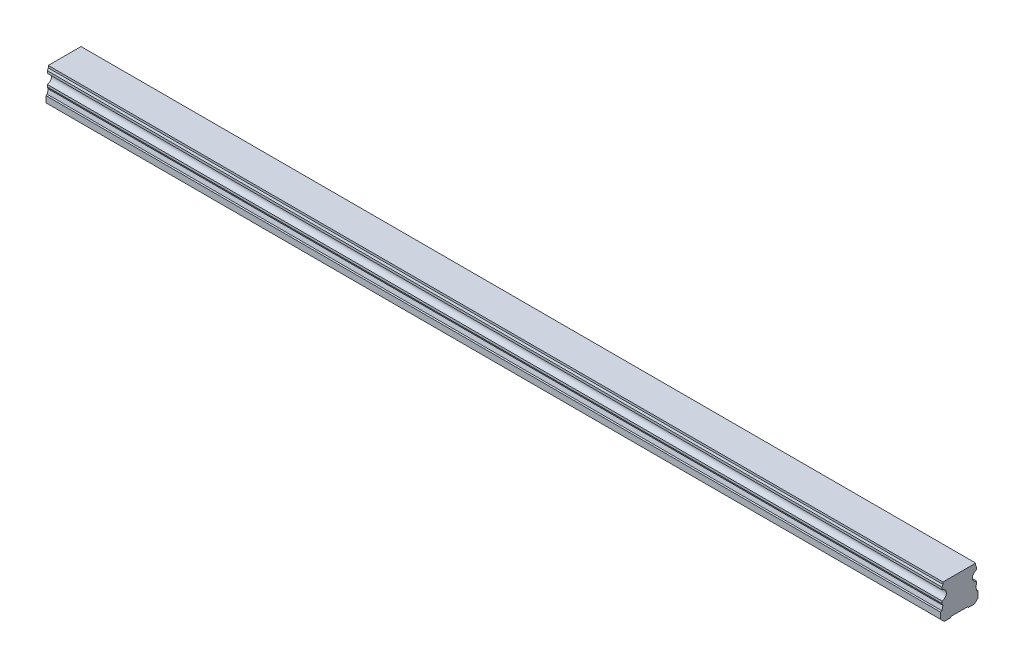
from build123d import *

# Parameters (mm, degrees)
BOSS_EXTRUDE1_DEPTH        = 360
SKETCH3_R                  = 2.5
SKETCH3_R_2                = 2.1
CUT_EXTRUDE3_DEPTH         = 7
SKETCH3_2_R                = 2.1
CUT_EXTRUDE4_DEPTH         = 9.5
CHAMFER1_SIZE              = 0.4
LPATTERN2_COUNT            = 6
LPATTERN2_PITCH            = 60
CHAMFER1_OF_LPATTERN2_SIZE = 0.4


with BuildPart() as part:
    # Sketch1 → Boss-Extrude1 (new body)
    with BuildSketch(Plane(origin=(0, 0, 0), x_dir=(0, 0, -1), z_dir=(1, 0, 0))):
        with BuildLine():
            Line((6.59, 14), (-6.59, 14))
            Line((-6.59, 14), (-6.59, 13.15))
            Line((-6.59, 13.15), (-6.96, 12.356532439))
            Line((-6.96, 12.356532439), (-6.96, 11.435174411))
            ThreePointArc((-6.96, 11.435174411), (-5.25, 9.5), (-6.96, 7.564825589))
            Line((-6.96, 7.564825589), (-6.96, 6.643467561))
            Line((-6.96, 6.643467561), (-6.59, 5.85))
            Line((-6.59, 5.85), (-7.032116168, 4.2))
            Line((-7.032116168, 4.2), (-7.5, 3.929867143))
            Line((-7.5, 3.929867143), (-7.5, 1.4))
            Line((-7.5, 1.4), (-6.1, 0))
            Line((-6.1, 0), (-3.65, 0))
            Line((-3.65, 0), (-3.25, 0.4))
            Line((-3.25, 0.4), (3.25, 0.4))
            Line((3.25, 0.4), (3.65, 0))
            Line((3.65, 0), (6.1, 0))
            Line((6.1, 0), (7.5, 1.4))
            Line((7.5, 1.4), (7.5, 3.929867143))
            Line((7.5, 3.929867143), (7.032116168, 4.2))
            Line((7.032116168, 4.2), (6.59, 5.85))
            Line((6.59, 5.85), (6.96, 6.643467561))
            Line((6.96, 6.643467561), (6.96, 7.564825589))
            ThreePointArc((6.96, 7.564825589), (5.25, 9.5), (6.96, 11.435174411))
            Line((6.96, 11.435174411), (6.96, 12.356532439))
            Line((6.96, 12.356532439), (6.59, 13.15))
            Line((6.59, 13.15), (6.59, 14))
        make_face()
    extrude(amount=BOSS_EXTRUDE1_DEPTH)

    # Sketch3 → Cut-Extrude3 (cut)
    with BuildSketch(Plane.XZ):
        with Locations(Location((30, 0, 0), (0, 0, 270))):
            Circle(SKETCH3_R)
        with Locations(Location((30, 0, 0), (0, 0, 270))):
            Circle(SKETCH3_R_2, mode=Mode.SUBTRACT)
    cut_extrude3 = extrude(amount=-CUT_EXTRUDE3_DEPTH, mode=Mode.SUBTRACT)

    # Sketch3_2 → Cut-Extrude4 (cut)
    with BuildSketch(Plane.XZ):
        with Locations(Location((30, 0, 0), (0, 0, 270))):
            Circle(SKETCH3_2_R)
    cut_extrude4 = extrude(amount=-CUT_EXTRUDE4_DEPTH, mode=Mode.SUBTRACT)

    # Cut-Extrude5 cone 1 section (on through the dimple's axis) → Cut-Extrude5 (revolve, cut)
    with BuildSketch(Plane(origin=(30, 9.5, 0), x_dir=(0, 0, -1), z_dir=(1, 0, 0))):
        Polygon((0, 0), (2.1, 0), (0, 1.212435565), align=None)
    revolve(axis=Axis((30, 9.5, 0), (0, 1, 0)), mode=Mode.SUBTRACT)

    # Chamfer1
    chamfer1_edges = [part.edges().sort_by_distance(p)[0] for p in [
        (30, 0.4, 2.5),
    ]]
    chamfer(chamfer1_edges, length=CHAMFER1_SIZE)

    # LPattern2: Cut-Extrude3, Cut-Extrude4 ×6
    with Locations(*[(i * LPATTERN2_PITCH, 0, 0) for i in range(1, LPATTERN2_COUNT)]):
        add(cut_extrude3, mode=Mode.SUBTRACT)
        add(cut_extrude4, mode=Mode.SUBTRACT)

    # Chamfer1 of LPattern2
    chamfer1_of_lpattern2_edges = [part.edges().sort_by_distance(p)[0] for p in [
        (90, 0.4, 2.5),
        (150, 0.4, 2.5),
        (210, 0.4, 2.5),
        (270, 0.4, 2.5),
        (330, 0.4, 2.5),
    ]]
    chamfer(chamfer1_of_lpattern2_edges, length=CHAMFER1_OF_LPATTERN2_SIZE)


solid = part.part
